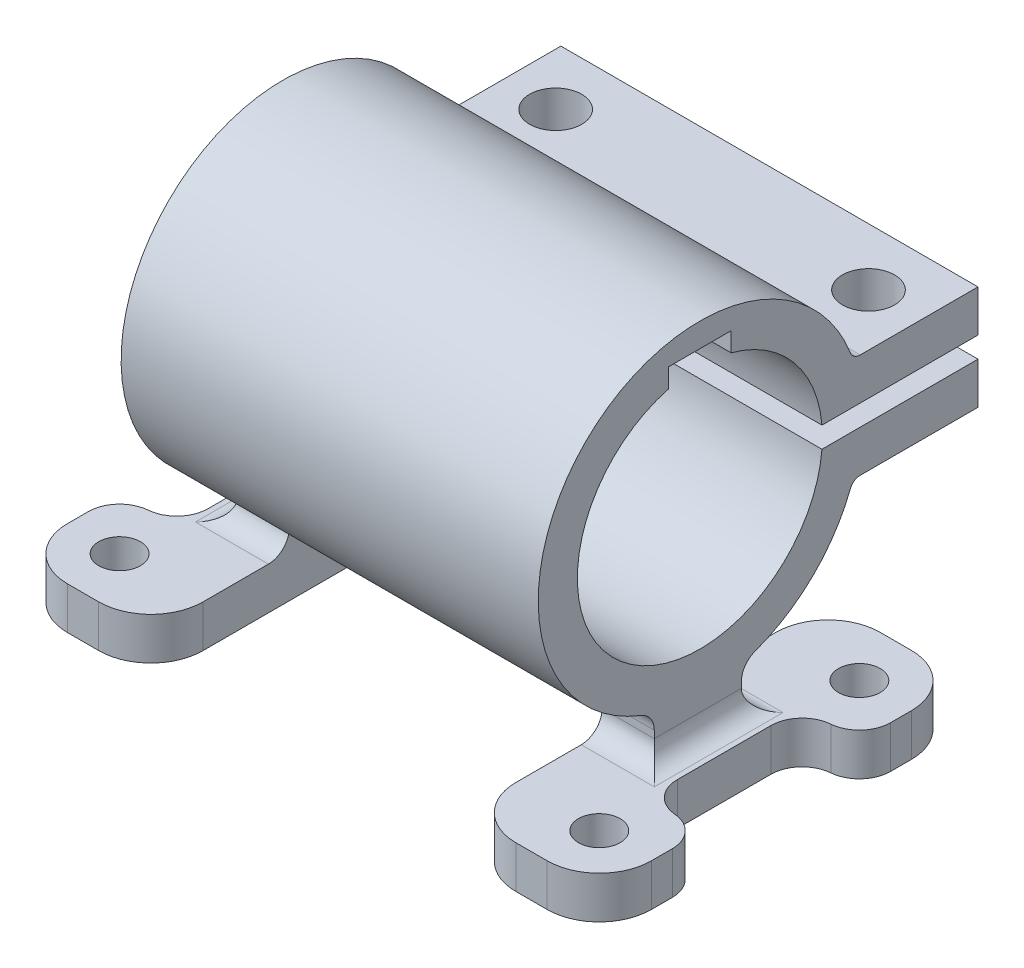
from build123d import *

# Parameters (mm, degrees)
BOSS_EXTRU_2_DEPTH      = 40
ESQUISSE6_R             = 2.5
ENL_V_MAT_EXTRU_2_DEPTH = 53.264841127
ESQUISSE7_W             = 8.348400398
ESQUISSE7_H             = 4.5
BOSS_EXTRU_3_DEPTH      = 5
ESQUISSE8_W             = 56
ESQUISSE8_H             = 34.937154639
BOSS_EXTRU_4_DEPTH      = 4.05
ESQUISSE9_R             = 2
ENL_V_MAT_EXTRU_3_DEPTH = 68.092966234
CONG_2_R                = 5
ENL_V_MAT_EXTRU_4_REACH = 69.093
ESQUISSE10_W            = 30
ESQUISSE10_H            = 40.755460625
CONG_4_R                = 5
ESQUISSE11_W            = 9.08797315
ESQUISSE11_H            = 14.937154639
ESQUISSE11_W_2          = 10.163953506
ENL_V_MAT_EXTRU_5_DEPTH = 65.850702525
CONG_8_R                = 3
CONG_9_R                = 3
ESQUISSE12_W            = 6
ESQUISSE12_H            = 3.051022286
ENL_V_MAT_EXTRU_6_DEPTH = 60.553892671
CONG_10_R               = 2
CONG_11_R               = 2


with BuildPart() as part:
    # Esquisse4 → Boss.-Extru.2 (new body)
    with BuildSketch(Plane(origin=(0, 0, 0), x_dir=(0, 0, -1), z_dir=(1, 0, 0))):
        with BuildLine():
            Line((15.370426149, 5), (26.671400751, 5))
            Line((26.671400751, 5), (26.671400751, 1))
            Line((26.671400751, 1), (11.707369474, 1))
            ThreePointArc((11.707369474, 1), (-11.75, 0), (11.707369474, -1))
            Line((11.707369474, -1), (26.671400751, -1))
            Line((26.671400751, -1), (26.671400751, -5))
            Line((26.671400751, -5), (15.370426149, -5))
            ThreePointArc((15.370426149, -5), (14.806350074, -5.174277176), (14.43888517, -5.636363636))
            ThreePointArc((14.43888517, -5.636363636), (-15.5, 0), (14.43888517, 5.636363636))
            ThreePointArc((14.43888517, 5.636363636), (14.806350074, 5.174277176), (15.370426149, 5))
        make_face()
    extrude(amount=BOSS_EXTRU_2_DEPTH)

    # Esquisse6 → Enl_v. mat.-Extru.2 (cut, through all)
    with BuildSketch(Plane(origin=(0, 5, 0), x_dir=(1, 0, 0), z_dir=(0, 1, 0))):
        with Locations(Location((5, 21.171400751, 0), (0, 0, 270))):
            Circle(ESQUISSE6_R)
        with Locations(Location((35, 21.171400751, 0), (0, 0, 270))):
            Circle(ESQUISSE6_R)
    extrude(amount=-ENL_V_MAT_EXTRU_2_DEPTH, mode=Mode.SUBTRACT)

    # Esquisse7 → Boss.-Extru.3 (add)
    with BuildSketch(Plane(origin=(35, 0, 0), x_dir=(0, 0, -1), z_dir=(1, 0, 0))):
        with Locations((-0.200590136, -16.75)):
            Rectangle(ESQUISSE7_W, ESQUISSE7_H)
    boss_extru_3 = extrude(amount=BOSS_EXTRU_3_DEPTH)

    # Esquisse8 → Boss.-Extru.4 (add)
    with BuildSketch(Plane.XZ.offset(19)):
        with Locations((20, 0.17766555)):
            Rectangle(ESQUISSE8_W, ESQUISSE8_H)
    extrude(amount=BOSS_EXTRU_4_DEPTH)

    # Esquisse9 → Enl_v. mat.-Extru.3 (cut, through all)
    with BuildSketch(Plane.XZ.offset(23.05)):
        with Locations(Location((-3, 12.646242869, 0), (0, 0, 270))):
            Circle(ESQUISSE9_R)
        with Locations(Location((43, 12.646242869, 0), (0, 0, 270))):
            Circle(ESQUISSE9_R)
        with Locations(Location((43, -12.29091177, 0), (0, 0, 270))):
            Circle(ESQUISSE9_R)
        with Locations(Location((-3, -12.29091177, 0), (0, 0, 270))):
            Circle(ESQUISSE9_R)
    extrude(amount=-ENL_V_MAT_EXTRU_3_DEPTH, mode=Mode.SUBTRACT)

    # Cong_2
    cong_2_edges = [part.edges().sort_by_distance(p)[0] for p in [
        (-8, -21.025, 17.646242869),
        (-8, -21.025, -17.29091177),
        (48, -21.025, -17.29091177),
        (48, -21.025, 17.646242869),
    ]]
    fillet(cong_2_edges, radius=CONG_2_R)

    # Sym_trie1: Boss.-Extru.3 across plane
    add(boss_extru_3.mirror(Plane(origin=(20, 0, 0), x_dir=(0, 0, 1), z_dir=(1, 0, 0))))

    # Esquisse10 → Enl_v. mat.-Extru.4 (cut, up to next)
    with BuildSketch(Plane.XZ.offset(23.05), mode=Mode.PRIVATE) as enl_v_mat_extru_4_sk1:
        with Locations((20, 0.177713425)):
            Rectangle(ESQUISSE10_W, ESQUISSE10_H)
    enl_v_mat_extru_4_tool1 = extrude(enl_v_mat_extru_4_sk1.sketch, amount=-ENL_V_MAT_EXTRU_4_REACH, mode=Mode.PRIVATE) & part.part
    add(enl_v_mat_extru_4_tool1.solids().sort_by_distance((20, -23.05, 0.177713))[0], mode=Mode.SUBTRACT)

    # Cong_4
    cong_4_edges = [part.edges().sort_by_distance(p)[0] for p in [
        (5, -21.025, 17.646242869),
        (35, -21.025, 17.646242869),
        (5, -21.025, -17.29091177),
        (35, -21.025, -17.29091177),
    ]]
    fillet(cong_4_edges, radius=CONG_4_R)

    # Esquisse11 → Enl_v. mat.-Extru.5 (cut, through all)
    with BuildSketch(Plane(origin=(0, -19, 0), x_dir=(1, 0, 0), z_dir=(0, 1, 0))):
        with Locations((47.043986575, -0.17766555)):
            Rectangle(ESQUISSE11_W, ESQUISSE11_H)
        with Locations((-7.581976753, -0.17766555)):
            Rectangle(ESQUISSE11_W_2, ESQUISSE11_H)
    extrude(amount=-ENL_V_MAT_EXTRU_5_DEPTH, mode=Mode.SUBTRACT)

    # Cong_8
    cong_8_edges = [part.edges().sort_by_distance(p)[0] for p in [
        (48, -21.025, 7.646242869),
        (48, -21.025, -7.29091177),
        (-8, -21.025, -7.29091177),
        (-8, -21.025, 7.646242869),
    ]]
    fillet(cong_8_edges, radius=CONG_8_R)

    # Cong_9
    cong_9_edges = [part.edges().sort_by_distance(p)[0] for p in [
        (-2.5, -21.025, -7.29091177),
        (42.5, -21.025, 7.646242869),
        (42.5, -21.025, -7.29091177),
        (-2.5, -21.025, 7.646242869),
    ]]
    fillet(cong_9_edges, radius=CONG_9_R)

    # Esquisse12 → Enl_v. mat.-Extru.6 (cut, through all)
    with BuildSketch(Plane.ZY):
        with Locations((0, 11.674488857)):
            Rectangle(ESQUISSE12_W, ESQUISSE12_H)
    extrude(amount=-ENL_V_MAT_EXTRU_6_DEPTH, mode=Mode.SUBTRACT)

    # Cong_10
    cong_10_edges = [part.edges().sort_by_distance(p)[0] for p in [
        (2.5, -19, 4.374790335),
        (0, -19, 0.200590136),
        (2.5, -19, -3.973610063),
        (40, -19, 0.200590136),
        (37.5, -19, -3.973610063),
        (37.5, -19, 4.374790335),
    ]]
    fillet(cong_10_edges, radius=CONG_10_R)

    # Cong_11
    cong_11_edges = [part.edges().sort_by_distance(p)[0] for p in [
        (2.5, -14.869808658, 4.374790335),
        (2.5, -14.982003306, -3.973610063),
        (37.5, -14.869808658, 4.374790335),
        (37.5, -14.982003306, -3.973610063),
    ]]
    fillet(cong_11_edges, radius=CONG_11_R)


solid = part.part
